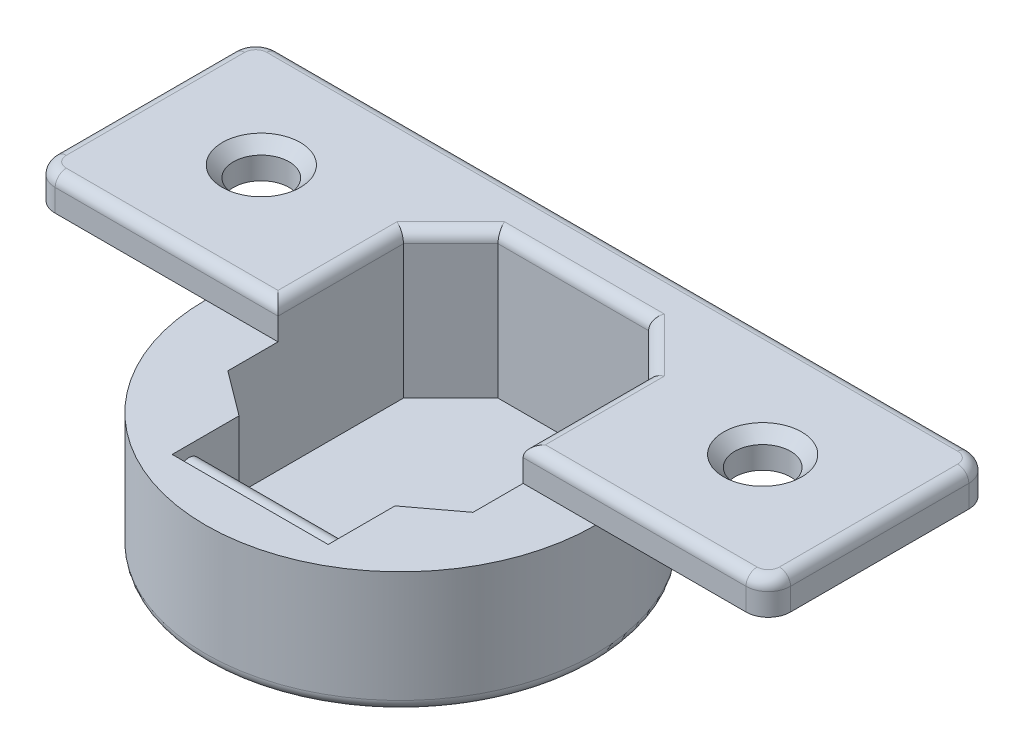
from build123d import *

# Parameters (mm, degrees)
SKIZZE1_R                           = 17.5
LINEAR_AUSTRAGEN1_DEPTH             = 11
LINEAR_AUSTRAGEN2_DEPTH             = 3
LINEAR_AUSTRAGEN3_DEPTH             = 13
LINEAR_AUSTRAGEN4_REACH             = 43.049
SKIZZE4_R                           = 1
LINEAR_AUSTRAGEN4_DIRECTION_2_REACH = 43.049
VERRUNDUNG1_R                       = 1
VERRUNDUNG2_R                       = 1
SKIZZE5_R                           = 2.5
LINEAR_AUSTRAGEN5_DEPTH             = 13
FASE1_SIZE                          = 1


with BuildPart() as part:
    # Skizze1 → Linear austragen1 (new body)
    with BuildSketch(Plane(origin=(0, 0, 0), x_dir=(1, 0, 0), z_dir=(0, 1, 0))):
        with Locations(Location((0, 0, 0), (0, 0, 270))):
            Circle(SKIZZE1_R)
    extrude(amount=LINEAR_AUSTRAGEN1_DEPTH)

    # Skizze2 → Linear austragen2 (add)
    with BuildSketch(Plane(origin=(0, 11, 0), x_dir=(1, 0, 0), z_dir=(0, 1, 0))):
        with BuildLine():
            Line((31, 20), (-31, 20))
            ThreePointArc((-31, 20), (-32.414213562, 19.414213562), (-33, 18))
            Line((-33, 18), (-33, 2))
            ThreePointArc((-33, 2), (-32.414213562, 0.585786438), (-31, 0))
            Line((-31, 0), (31, 0))
            ThreePointArc((31, 0), (32.414213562, 0.585786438), (33, 2))
            Line((33, 2), (33, 18))
            ThreePointArc((33, 18), (32.414213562, 19.414213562), (31, 20))
        make_face()
    extrude(amount=LINEAR_AUSTRAGEN2_DEPTH)

    # Skizze3 → Linear austragen3 (cut)
    with BuildSketch(Plane(origin=(0, 14, 0), x_dir=(1, 0, 0), z_dir=(0, 1, 0))):
        Polygon((-11, 11.257359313), (-6.757359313, 15.5), (0, 15.5), (6.757359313, 15.5), (11, 11.257359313), (11, -4.5), (7, -7.5), (7, -13.5), (-7, -13.5), (-7, -7.5), (-11, -4.5), align=None)
    extrude(amount=-LINEAR_AUSTRAGEN3_DEPTH, mode=Mode.SUBTRACT)

    # Linear austragen4: up to this face of the body (flat: up to its plane)
    linear_austragen4_end = Plane(part.part.faces().sort_by_distance((7, 6, 10.5))[0])
    # Skizze4 → Linear austragen4 (add, up to the picked face)
    with BuildSketch(Plane(origin=(0, 0, 0), x_dir=(0, 0, -1), z_dir=(1, 0, 0)), mode=Mode.PRIVATE) as linear_austragen4_sk1:
        with Locations(Location((-12, 9, 0), (0, 0, 180))):
            Circle(SKIZZE4_R)
    linear_austragen4_tool1 = split(extrude(linear_austragen4_sk1.sketch, amount=LINEAR_AUSTRAGEN4_REACH, mode=Mode.PRIVATE), bisect_by=linear_austragen4_end, keep=Keep.BOTH, mode=Mode.PRIVATE)
    # Skizze4 → Linear austragen4 (add, up to the picked face)
    with BuildSketch(Plane(origin=(0, 0, 0), x_dir=(0, 0, -1), z_dir=(1, 0, 0)), mode=Mode.PRIVATE) as linear_austragen4_sk2:
        with Locations(Location((-8, 5, 0), (0, 0, 300))):
            Circle(SKIZZE4_R)
    linear_austragen4_tool2 = split(extrude(linear_austragen4_sk2.sketch, amount=LINEAR_AUSTRAGEN4_REACH, mode=Mode.PRIVATE), bisect_by=linear_austragen4_end, keep=Keep.BOTH, mode=Mode.PRIVATE)
    add(linear_austragen4_tool1.solids().sort_by(Axis((0, 9, 12), (1, 0, 0)))[0])
    add(linear_austragen4_tool2.solids().sort_by(Axis((0, 5, 8), (1, 0, 0)))[0])

    # Linear austragen4 direction 2: up to this face of the body (flat: up to its plane)
    linear_austragen4_direction_2_end = Plane(part.part.faces().sort_by_distance((-7, 6, 10.5))[0])
    # Skizze4 → Linear austragen4 direction 2 (add, up to the picked face)
    with BuildSketch(Plane(origin=(0, 0, 0), x_dir=(0, 0, -1), z_dir=(1, 0, 0)), mode=Mode.PRIVATE) as linear_austragen4_direction_2_sk1:
        with Locations(Location((-12, 9, 0), (0, 0, 180))):
            Circle(SKIZZE4_R)
    linear_austragen4_direction_2_tool1 = split(extrude(linear_austragen4_direction_2_sk1.sketch, amount=-LINEAR_AUSTRAGEN4_DIRECTION_2_REACH, mode=Mode.PRIVATE), bisect_by=linear_austragen4_direction_2_end, keep=Keep.BOTH, mode=Mode.PRIVATE)
    # Skizze4 → Linear austragen4 direction 2 (add, up to the picked face)
    with BuildSketch(Plane(origin=(0, 0, 0), x_dir=(0, 0, -1), z_dir=(1, 0, 0)), mode=Mode.PRIVATE) as linear_austragen4_direction_2_sk2:
        with Locations(Location((-8, 5, 0), (0, 0, 300))):
            Circle(SKIZZE4_R)
    linear_austragen4_direction_2_tool2 = split(extrude(linear_austragen4_direction_2_sk2.sketch, amount=-LINEAR_AUSTRAGEN4_DIRECTION_2_REACH, mode=Mode.PRIVATE), bisect_by=linear_austragen4_direction_2_end, keep=Keep.BOTH, mode=Mode.PRIVATE)
    add(linear_austragen4_direction_2_tool1.solids().sort_by(Axis((0, 9, 12), (-1, 0, 0)))[0])
    add(linear_austragen4_direction_2_tool2.solids().sort_by(Axis((0, 5, 8), (-1, 0, 0)))[0])

    # Verrundung1
    verrundung1_edges = [part.edges().sort_by_distance(p)[0] for p in [
        (0, 14, -20),
        (-32.414213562, 14, -19.414213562),
        (-33, 14, -10),
        (-32.414213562, 14, -0.585786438),
        (-21, 14, 0),
        (32.414213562, 14, -0.585786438),
        (33, 14, -10),
        (21, 14, 0),
        (11, 14, -5.628679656),
        (8.878679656, 14, -13.378679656),
        (0, 14, -15.5),
        (-8.878679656, 14, -13.378679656),
        (-11, 14, -5.628679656),
        (32.414213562, 14, -19.414213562),
    ]]
    fillet(verrundung1_edges, radius=VERRUNDUNG1_R)

    # Verrundung2
    verrundung2_edges = [part.edges().sort_by_distance(p)[0] for p in [
        (0, 0, -17.5),
    ]]
    fillet(verrundung2_edges, radius=VERRUNDUNG2_R)

    # Skizze5 → Linear austragen5 (cut)
    with BuildSketch(Plane(origin=(0, 14, 0), x_dir=(1, 0, 0), z_dir=(0, 1, 0))):
        with Locations(Location((-22.5, 10, 0), (0, 0, 270))):
            Circle(SKIZZE5_R)
        with Locations(Location((22.5, 10, 0), (0, 0, 270))):
            Circle(SKIZZE5_R)
    extrude(amount=-LINEAR_AUSTRAGEN5_DEPTH, mode=Mode.SUBTRACT)

    # Fase1
    fase1_edges = [part.edges().sort_by_distance(p)[0] for p in [
        (-22.5, 14, -12.5),
        (22.5, 14, -12.5),
    ]]
    chamfer(fase1_edges, length=FASE1_SIZE)


solid = part.part
